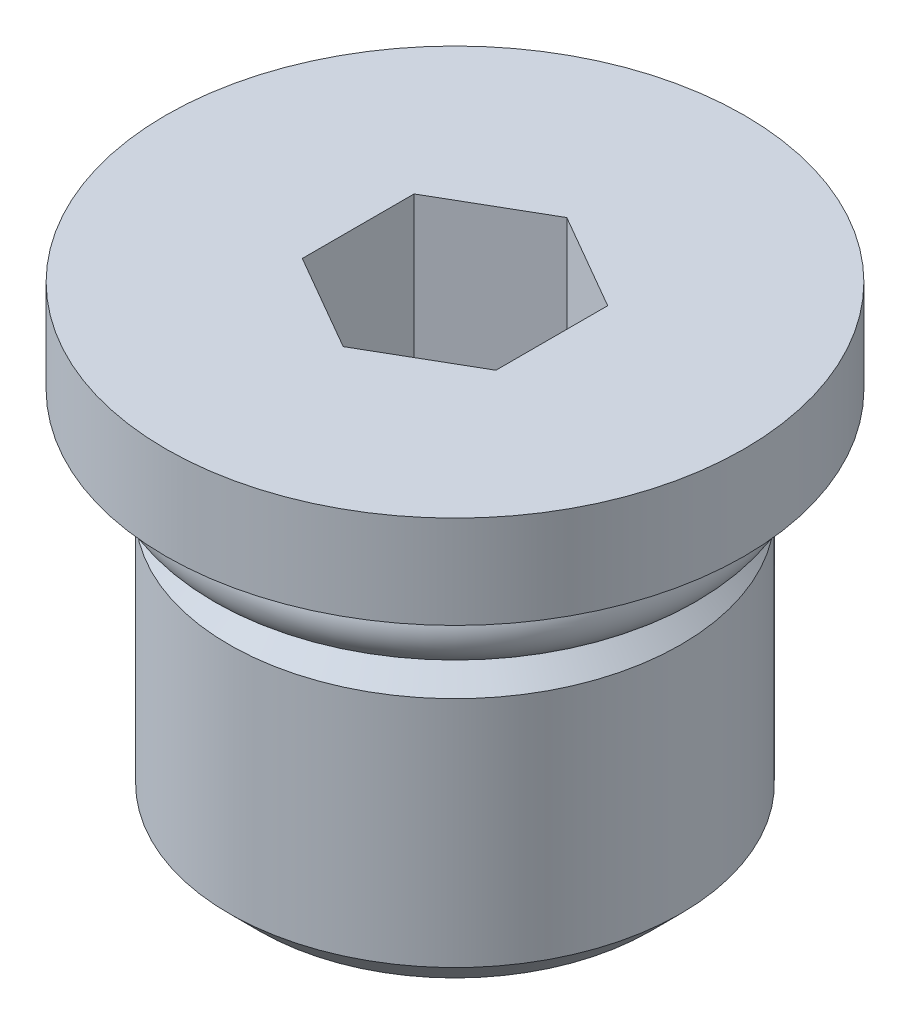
ISO-10303-21;
HEADER;
FILE_DESCRIPTION(('STEP AP214'),'2;1');
FILE_NAME('part.step','',(''),(''),'','','');
FILE_SCHEMA(('AUTOMOTIVE_DESIGN { 1 0 10303 214 1 1 1 1 }'));
ENDSEC;
DATA;
#1=APPLICATION_CONTEXT('core data for automotive mechanical design processes');
#2=APPLICATION_PROTOCOL_DEFINITION('international standard','automotive_design',2000,#1);
#3=PRODUCT_CONTEXT('',#1,'mechanical');
#4=PRODUCT('Part','Part','',(#3));
#5=PRODUCT_RELATED_PRODUCT_CATEGORY('part','',(#4));
#6=PRODUCT_DEFINITION_FORMATION('','',#4);
#7=PRODUCT_DEFINITION_CONTEXT('part definition',#1,'design');
#8=PRODUCT_DEFINITION('design','',#6,#7);
#9=PRODUCT_DEFINITION_SHAPE('','',#8);
#10=(LENGTH_UNIT() NAMED_UNIT(*) SI_UNIT(.MILLI.,.METRE.));
#11=(NAMED_UNIT(*) PLANE_ANGLE_UNIT() SI_UNIT($,.RADIAN.));
#12=(NAMED_UNIT(*) SI_UNIT($,.STERADIAN.) SOLID_ANGLE_UNIT());
#13=UNCERTAINTY_MEASURE_WITH_UNIT(LENGTH_MEASURE(1.E-05),#10,'distance_accuracy_value','');
#14=(GEOMETRIC_REPRESENTATION_CONTEXT(3) GLOBAL_UNCERTAINTY_ASSIGNED_CONTEXT((#13)) GLOBAL_UNIT_ASSIGNED_CONTEXT((#10,
#11,#12)) REPRESENTATION_CONTEXT('',''));
#15=CARTESIAN_POINT('',(0.,0.,0.));
#16=DIRECTION('',(0.,0.,1.));
#17=DIRECTION('',(1.,0.,0.));
#18=AXIS2_PLACEMENT_3D('',#15,#16,#17);
#19=CARTESIAN_POINT('',(0.,0.,0.));
#20=DIRECTION('',(0.,-1.,0.));
#21=DIRECTION('',(1.,0.,0.));
#22=AXIS2_PLACEMENT_3D('',#19,#20,#21);
#23=CYLINDRICAL_SURFACE('',#22,4.8006);
#24=CARTESIAN_POINT('',(0.,0.,0.));
#25=DIRECTION('',(0.,-1.,0.));
#26=DIRECTION('',(1.,0.,0.));
#27=AXIS2_PLACEMENT_3D('',#24,#25,#26);
#28=CIRCLE('',#27,4.8006);
#29=CARTESIAN_POINT('',(4.8006,0.,0.));
#30=VERTEX_POINT('',#29);
#31=EDGE_CURVE('E157',#30,#30,#28,.T.);
#32=ORIENTED_EDGE('',*,*,#31,.T.);
#33=EDGE_LOOP('',(#32));
#34=FACE_BOUND('',#33,.T.);
#35=CARTESIAN_POINT('',(0.,-0.165417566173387,0.));
#36=DIRECTION('',(0.,-1.,0.));
#37=DIRECTION('',(0.,0.,-1.));
#38=AXIS2_PLACEMENT_3D('',#35,#36,#37);
#39=CIRCLE('',#38,4.8006);
#40=CARTESIAN_POINT('',(0.,-0.165417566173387,-4.8006));
#41=VERTEX_POINT('',#40);
#42=EDGE_CURVE('E44',#41,#41,#39,.F.);
#43=ORIENTED_EDGE('',*,*,#42,.T.);
#44=EDGE_LOOP('',(#43));
#45=FACE_BOUND('',#44,.T.);
#46=ADVANCED_FACE('F40',(#34,#45),#23,.T.);
#47=CARTESIAN_POINT('',(-3.33066907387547E-13,2.28600000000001,0.));
#48=DIRECTION('',(0.,1.,0.));
#49=DIRECTION('',(-1.,0.,0.));
#50=AXIS2_PLACEMENT_3D('',#47,#48,#49);
#51=PLANE('',#50);
#52=DIRECTION('',(-0.866025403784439,0.,-0.5));
#53=VECTOR('',#52,1.);
#54=CARTESIAN_POINT('',(2.38124999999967,2.28600000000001,-1.3748153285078));
#55=LINE('',#54,#53);
#56=CARTESIAN_POINT('',(2.38124999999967,2.28600000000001,-1.3748153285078));
#57=VERTEX_POINT('',#56);
#58=CARTESIAN_POINT('',(-3.33066907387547E-13,2.28600000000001,-2.74963065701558));
#59=VERTEX_POINT('',#58);
#60=EDGE_CURVE('E57',#57,#59,#55,.T.);
#61=ORIENTED_EDGE('',*,*,#60,.F.);
#62=DIRECTION('',(0.,0.,-1.));
#63=VECTOR('',#62,1.);
#64=CARTESIAN_POINT('',(2.38124999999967,2.28600000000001,1.3748153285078));
#65=LINE('',#64,#63);
#66=CARTESIAN_POINT('',(2.38124999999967,2.28600000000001,1.3748153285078));
#67=VERTEX_POINT('',#66);
#68=EDGE_CURVE('E127',#67,#57,#65,.T.);
#69=ORIENTED_EDGE('',*,*,#68,.F.);
#70=DIRECTION('',(0.866025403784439,0.,-0.5));
#71=VECTOR('',#70,1.);
#72=CARTESIAN_POINT('',(-3.33066907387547E-13,2.28600000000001,2.74963065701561));
#73=LINE('',#72,#71);
#74=CARTESIAN_POINT('',(-3.33066907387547E-13,2.28600000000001,2.74963065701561));
#75=VERTEX_POINT('',#74);
#76=EDGE_CURVE('E121',#75,#67,#73,.T.);
#77=ORIENTED_EDGE('',*,*,#76,.F.);
#78=DIRECTION('',(0.866025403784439,0.,0.5));
#79=VECTOR('',#78,1.);
#80=CARTESIAN_POINT('',(-2.38125000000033,2.28600000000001,1.3748153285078));
#81=LINE('',#80,#79);
#82=CARTESIAN_POINT('',(-2.38125000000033,2.28600000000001,1.3748153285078));
#83=VERTEX_POINT('',#82);
#84=EDGE_CURVE('E119',#83,#75,#81,.T.);
#85=ORIENTED_EDGE('',*,*,#84,.F.);
#86=DIRECTION('',(0.,0.,1.));
#87=VECTOR('',#86,1.);
#88=CARTESIAN_POINT('',(-2.38125000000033,2.28600000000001,-1.37481532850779));
#89=LINE('',#88,#87);
#90=CARTESIAN_POINT('',(-2.38125000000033,2.28600000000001,-1.37481532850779));
#91=VERTEX_POINT('',#90);
#92=EDGE_CURVE('E100',#91,#83,#89,.T.);
#93=ORIENTED_EDGE('',*,*,#92,.F.);
#94=DIRECTION('',(-0.866025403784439,0.,0.5));
#95=VECTOR('',#94,1.);
#96=CARTESIAN_POINT('',(-3.33066907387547E-13,2.28600000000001,-2.74963065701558));
#97=LINE('',#96,#95);
#98=EDGE_CURVE('E111',#59,#91,#97,.T.);
#99=ORIENTED_EDGE('',*,*,#98,.F.);
#100=EDGE_LOOP('',(#61,#69,#77,#85,#93,#99));
#101=FACE_BOUND('',#100,.T.);
#102=CARTESIAN_POINT('',(-3.33066907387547E-13,2.28600000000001,0.));
#103=DIRECTION('',(0.,-1.,0.));
#104=DIRECTION('',(1.,0.,0.));
#105=AXIS2_PLACEMENT_3D('',#102,#103,#104);
#106=CIRCLE('',#105,7.112);
#107=CARTESIAN_POINT('',(7.11199999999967,2.28600000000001,0.));
#108=VERTEX_POINT('',#107);
#109=EDGE_CURVE('E163',#108,#108,#106,.T.);
#110=ORIENTED_EDGE('',*,*,#109,.F.);
#111=EDGE_LOOP('',(#110));
#112=FACE_BOUND('',#111,.T.);
#113=ADVANCED_FACE('F115',(#101,#112),#51,.T.);
#114=CARTESIAN_POINT('',(0.,0.,0.));
#115=DIRECTION('',(0.,-1.,0.));
#116=DIRECTION('',(1.,0.,0.));
#117=AXIS2_PLACEMENT_3D('',#114,#115,#116);
#118=CYLINDRICAL_SURFACE('',#117,7.112);
#119=ORIENTED_EDGE('',*,*,#109,.T.);
#120=EDGE_LOOP('',(#119));
#121=FACE_BOUND('',#120,.T.);
#122=CARTESIAN_POINT('',(0.,0.,0.));
#123=DIRECTION('',(0.,-1.,0.));
#124=DIRECTION('',(1.,0.,0.));
#125=AXIS2_PLACEMENT_3D('',#122,#123,#124);
#126=CIRCLE('',#125,7.112);
#127=CARTESIAN_POINT('',(7.112,0.,0.));
#128=VERTEX_POINT('',#127);
#129=EDGE_CURVE('E160',#128,#128,#126,.T.);
#130=ORIENTED_EDGE('',*,*,#129,.F.);
#131=EDGE_LOOP('',(#130));
#132=FACE_BOUND('',#131,.T.);
#133=ADVANCED_FACE('F197',(#121,#132),#118,.T.);
#134=CARTESIAN_POINT('',(7.11200000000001,0.,0.));
#135=DIRECTION('',(0.,-1.,0.));
#136=DIRECTION('',(1.,0.,0.));
#137=AXIS2_PLACEMENT_3D('',#134,#135,#136);
#138=PLANE('',#137);
#139=ORIENTED_EDGE('',*,*,#129,.T.);
#140=EDGE_LOOP('',(#139));
#141=FACE_BOUND('',#140,.T.);
#142=ORIENTED_EDGE('',*,*,#31,.F.);
#143=EDGE_LOOP('',(#142));
#144=FACE_BOUND('',#143,.T.);
#145=ADVANCED_FACE('F223',(#141,#144),#138,.T.);
#146=CARTESIAN_POINT('',(2.38125,-2.47649999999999,-1.3748153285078));
#147=DIRECTION('',(0.5,0.,-0.866025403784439));
#148=DIRECTION('',(-0.866025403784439,0.,-0.5));
#149=AXIS2_PLACEMENT_3D('',#146,#147,#148);
#150=PLANE('',#149);
#151=ORIENTED_EDGE('',*,*,#60,.T.);
#152=DIRECTION('',(0.,1.,0.));
#153=VECTOR('',#152,1.);
#154=CARTESIAN_POINT('',(0.,-2.47649999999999,-2.74963065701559));
#155=LINE('',#154,#153);
#156=CARTESIAN_POINT('',(0.,-2.47649999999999,-2.74963065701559));
#157=VERTEX_POINT('',#156);
#158=EDGE_CURVE('E108',#157,#59,#155,.T.);
#159=ORIENTED_EDGE('',*,*,#158,.F.);
#160=DIRECTION('',(-0.866025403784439,0.,-0.5));
#161=VECTOR('',#160,1.);
#162=CARTESIAN_POINT('',(2.38125,-2.47649999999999,-1.3748153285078));
#163=LINE('',#162,#161);
#164=CARTESIAN_POINT('',(2.38125,-2.47649999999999,-1.3748153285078));
#165=VERTEX_POINT('',#164);
#166=EDGE_CURVE('E129',#165,#157,#163,.T.);
#167=ORIENTED_EDGE('',*,*,#166,.F.);
#168=DIRECTION('',(0.,1.,0.));
#169=VECTOR('',#168,1.);
#170=CARTESIAN_POINT('',(2.38125,-2.47649999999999,-1.3748153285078));
#171=LINE('',#170,#169);
#172=EDGE_CURVE('E64',#165,#57,#171,.T.);
#173=ORIENTED_EDGE('',*,*,#172,.T.);
#174=EDGE_LOOP('',(#151,#159,#167,#173));
#175=FACE_BOUND('',#174,.T.);
#176=ADVANCED_FACE('F226',(#175),#150,.F.);
#177=CARTESIAN_POINT('',(2.38125,-2.47649999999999,1.3748153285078));
#178=DIRECTION('',(1.,0.,0.));
#179=DIRECTION('',(0.,0.,-1.));
#180=AXIS2_PLACEMENT_3D('',#177,#178,#179);
#181=PLANE('',#180);
#182=ORIENTED_EDGE('',*,*,#68,.T.);
#183=ORIENTED_EDGE('',*,*,#172,.F.);
#184=DIRECTION('',(0.,0.,-1.));
#185=VECTOR('',#184,1.);
#186=CARTESIAN_POINT('',(2.38125,-2.47649999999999,1.3748153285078));
#187=LINE('',#186,#185);
#188=CARTESIAN_POINT('',(2.38125,-2.47649999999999,1.3748153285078));
#189=VERTEX_POINT('',#188);
#190=EDGE_CURVE('E141',#189,#165,#187,.T.);
#191=ORIENTED_EDGE('',*,*,#190,.F.);
#192=DIRECTION('',(0.,1.,0.));
#193=VECTOR('',#192,1.);
#194=CARTESIAN_POINT('',(2.38125,-2.47649999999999,1.3748153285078));
#195=LINE('',#194,#193);
#196=EDGE_CURVE('E146',#189,#67,#195,.T.);
#197=ORIENTED_EDGE('',*,*,#196,.T.);
#198=EDGE_LOOP('',(#182,#183,#191,#197));
#199=FACE_BOUND('',#198,.T.);
#200=ADVANCED_FACE('F231',(#199),#181,.F.);
#201=CARTESIAN_POINT('',(0.,-2.47649999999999,2.74963065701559));
#202=DIRECTION('',(0.5,0.,0.866025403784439));
#203=DIRECTION('',(0.866025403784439,0.,-0.5));
#204=AXIS2_PLACEMENT_3D('',#201,#202,#203);
#205=PLANE('',#204);
#206=ORIENTED_EDGE('',*,*,#76,.T.);
#207=ORIENTED_EDGE('',*,*,#196,.F.);
#208=DIRECTION('',(0.866025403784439,0.,-0.5));
#209=VECTOR('',#208,1.);
#210=CARTESIAN_POINT('',(0.,-2.47649999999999,2.74963065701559));
#211=LINE('',#210,#209);
#212=CARTESIAN_POINT('',(0.,-2.47649999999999,2.74963065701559));
#213=VERTEX_POINT('',#212);
#214=EDGE_CURVE('E138',#213,#189,#211,.T.);
#215=ORIENTED_EDGE('',*,*,#214,.F.);
#216=DIRECTION('',(0.,1.,0.));
#217=VECTOR('',#216,1.);
#218=CARTESIAN_POINT('',(0.,-2.47649999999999,2.74963065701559));
#219=LINE('',#218,#217);
#220=EDGE_CURVE('E148',#213,#75,#219,.T.);
#221=ORIENTED_EDGE('',*,*,#220,.T.);
#222=EDGE_LOOP('',(#206,#207,#215,#221));
#223=FACE_BOUND('',#222,.T.);
#224=ADVANCED_FACE('F240',(#223),#205,.F.);
#225=CARTESIAN_POINT('',(-2.38125,-2.47649999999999,1.3748153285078));
#226=DIRECTION('',(-0.5,0.,0.866025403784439));
#227=DIRECTION('',(0.866025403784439,0.,0.5));
#228=AXIS2_PLACEMENT_3D('',#225,#226,#227);
#229=PLANE('',#228);
#230=ORIENTED_EDGE('',*,*,#84,.T.);
#231=ORIENTED_EDGE('',*,*,#220,.F.);
#232=DIRECTION('',(0.866025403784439,0.,0.5));
#233=VECTOR('',#232,1.);
#234=CARTESIAN_POINT('',(-2.38125,-2.47649999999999,1.3748153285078));
#235=LINE('',#234,#233);
#236=CARTESIAN_POINT('',(-2.38125,-2.47649999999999,1.3748153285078));
#237=VERTEX_POINT('',#236);
#238=EDGE_CURVE('E135',#237,#213,#235,.T.);
#239=ORIENTED_EDGE('',*,*,#238,.F.);
#240=DIRECTION('',(0.,1.,0.));
#241=VECTOR('',#240,1.);
#242=CARTESIAN_POINT('',(-2.38125,-2.47649999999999,1.3748153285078));
#243=LINE('',#242,#241);
#244=EDGE_CURVE('E107',#237,#83,#243,.T.);
#245=ORIENTED_EDGE('',*,*,#244,.T.);
#246=EDGE_LOOP('',(#230,#231,#239,#245));
#247=FACE_BOUND('',#246,.T.);
#248=ADVANCED_FACE('F247',(#247),#229,.F.);
#249=CARTESIAN_POINT('',(-2.38125,-2.47649999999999,-1.3748153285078));
#250=DIRECTION('',(-1.,0.,0.));
#251=DIRECTION('',(0.,-1.,0.));
#252=AXIS2_PLACEMENT_3D('',#249,#250,#251);
#253=PLANE('',#252);
#254=ORIENTED_EDGE('',*,*,#92,.T.);
#255=ORIENTED_EDGE('',*,*,#244,.F.);
#256=DIRECTION('',(0.,0.,1.));
#257=VECTOR('',#256,1.);
#258=CARTESIAN_POINT('',(-2.38125,-2.47649999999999,-1.3748153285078));
#259=LINE('',#258,#257);
#260=CARTESIAN_POINT('',(-2.38125,-2.47649999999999,-1.3748153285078));
#261=VERTEX_POINT('',#260);
#262=EDGE_CURVE('E103',#261,#237,#259,.T.);
#263=ORIENTED_EDGE('',*,*,#262,.F.);
#264=DIRECTION('',(0.,1.,0.));
#265=VECTOR('',#264,1.);
#266=CARTESIAN_POINT('',(-2.38125,-2.47649999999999,-1.3748153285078));
#267=LINE('',#266,#265);
#268=EDGE_CURVE('E96',#261,#91,#267,.T.);
#269=ORIENTED_EDGE('',*,*,#268,.T.);
#270=EDGE_LOOP('',(#254,#255,#263,#269));
#271=FACE_BOUND('',#270,.T.);
#272=ADVANCED_FACE('F98',(#271),#253,.F.);
#273=CARTESIAN_POINT('',(0.,-2.47649999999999,-2.74963065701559));
#274=DIRECTION('',(-0.5,0.,-0.866025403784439));
#275=DIRECTION('',(-0.866025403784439,0.,0.5));
#276=AXIS2_PLACEMENT_3D('',#273,#274,#275);
#277=PLANE('',#276);
#278=ORIENTED_EDGE('',*,*,#98,.T.);
#279=ORIENTED_EDGE('',*,*,#268,.F.);
#280=DIRECTION('',(-0.866025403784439,0.,0.5));
#281=VECTOR('',#280,1.);
#282=CARTESIAN_POINT('',(0.,-2.47649999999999,-2.74963065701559));
#283=LINE('',#282,#281);
#284=EDGE_CURVE('E132',#157,#261,#283,.T.);
#285=ORIENTED_EDGE('',*,*,#284,.F.);
#286=ORIENTED_EDGE('',*,*,#158,.T.);
#287=EDGE_LOOP('',(#278,#279,#285,#286));
#288=FACE_BOUND('',#287,.T.);
#289=ADVANCED_FACE('F112',(#288),#277,.F.);
#290=CARTESIAN_POINT('',(2.38125,-2.47649999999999,-1.3748153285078));
#291=DIRECTION('',(0.,-1.,0.));
#292=DIRECTION('',(0.,0.,-1.));
#293=AXIS2_PLACEMENT_3D('',#290,#291,#292);
#294=PLANE('',#293);
#295=ORIENTED_EDGE('',*,*,#166,.T.);
#296=ORIENTED_EDGE('',*,*,#284,.T.);
#297=ORIENTED_EDGE('',*,*,#262,.T.);
#298=ORIENTED_EDGE('',*,*,#238,.T.);
#299=ORIENTED_EDGE('',*,*,#214,.T.);
#300=ORIENTED_EDGE('',*,*,#190,.T.);
#301=EDGE_LOOP('',(#295,#296,#297,#298,#299,#300));
#302=FACE_BOUND('',#301,.T.);
#303=ADVANCED_FACE('F179',(#302),#294,.F.);
#304=CARTESIAN_POINT('',(0.,-0.927099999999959,0.));
#305=DIRECTION('',(0.,1.,0.));
#306=DIRECTION('',(0.,0.,1.));
#307=AXIS2_PLACEMENT_3D('',#304,#305,#306);
#308=TOROIDAL_SURFACE('',#307,5.2832,0.9017);
#309=ORIENTED_EDGE('',*,*,#42,.F.);
#310=EDGE_LOOP('',(#309));
#311=FACE_BOUND('',#310,.T.);
#312=CARTESIAN_POINT('',(0.,-1.68878243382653,0.));
#313=DIRECTION('',(0.,1.,0.));
#314=DIRECTION('',(0.,0.,1.));
#315=AXIS2_PLACEMENT_3D('',#312,#313,#314);
#316=CIRCLE('',#315,4.8006);
#317=CARTESIAN_POINT('',(0.,-1.68878243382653,4.8006));
#318=VERTEX_POINT('',#317);
#319=EDGE_CURVE('E167',#318,#318,#316,.F.);
#320=ORIENTED_EDGE('',*,*,#319,.F.);
#321=EDGE_LOOP('',(#320));
#322=FACE_BOUND('',#321,.T.);
#323=ADVANCED_FACE('F175',(#311,#322),#308,.T.);
#324=CARTESIAN_POINT('',(4.80060000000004,-9.14400000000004,0.));
#325=DIRECTION('',(0.,-1.,0.));
#326=DIRECTION('',(1.,0.,0.));
#327=AXIS2_PLACEMENT_3D('',#324,#325,#326);
#328=PLANE('',#327);
#329=CARTESIAN_POINT('',(0.,-9.14400000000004,0.));
#330=DIRECTION('',(0.,-1.,0.));
#331=DIRECTION('',(1.,0.,0.));
#332=AXIS2_PLACEMENT_3D('',#329,#330,#331);
#333=CIRCLE('',#332,4.8006);
#334=CARTESIAN_POINT('',(4.8006,-9.14400000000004,0.));
#335=VERTEX_POINT('',#334);
#336=EDGE_CURVE('E49',#335,#335,#333,.T.);
#337=ORIENTED_EDGE('',*,*,#336,.T.);
#338=EDGE_LOOP('',(#337));
#339=FACE_BOUND('',#338,.T.);
#340=ADVANCED_FACE('F178',(#339),#328,.T.);
#341=CARTESIAN_POINT('',(0.,-9.14400000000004,0.));
#342=DIRECTION('',(0.,1.,0.));
#343=DIRECTION('',(-1.,0.,0.));
#344=AXIS2_PLACEMENT_3D('',#341,#342,#343);
#345=CONICAL_SURFACE('',#344,4.8006,0.785398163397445);
#346=CARTESIAN_POINT('',(0.,-8.38834999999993,0.));
#347=DIRECTION('',(0.,-1.,0.));
#348=DIRECTION('',(1.,0.,0.));
#349=AXIS2_PLACEMENT_3D('',#346,#347,#348);
#350=CIRCLE('',#349,5.55625);
#351=CARTESIAN_POINT('',(5.55625,-8.38834999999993,0.));
#352=VERTEX_POINT('',#351);
#353=EDGE_CURVE('E11',#352,#352,#350,.T.);
#354=ORIENTED_EDGE('',*,*,#353,.T.);
#355=EDGE_LOOP('',(#354));
#356=FACE_BOUND('',#355,.T.);
#357=ORIENTED_EDGE('',*,*,#336,.F.);
#358=EDGE_LOOP('',(#357));
#359=FACE_BOUND('',#358,.T.);
#360=ADVANCED_FACE('F185',(#356,#359),#345,.T.);
#361=CARTESIAN_POINT('',(0.,0.,0.));
#362=DIRECTION('',(0.,-1.,0.));
#363=DIRECTION('',(1.,0.,0.));
#364=AXIS2_PLACEMENT_3D('',#361,#362,#363);
#365=CYLINDRICAL_SURFACE('',#364,5.55625);
#366=CARTESIAN_POINT('',(0.,-2.66064999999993,0.));
#367=DIRECTION('',(0.,-1.,0.));
#368=DIRECTION('',(1.,0.,0.));
#369=AXIS2_PLACEMENT_3D('',#366,#367,#368);
#370=CIRCLE('',#369,5.55625);
#371=CARTESIAN_POINT('',(5.55625,-2.66064999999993,0.));
#372=VERTEX_POINT('',#371);
#373=EDGE_CURVE('E145',#372,#372,#370,.T.);
#374=ORIENTED_EDGE('',*,*,#373,.T.);
#375=EDGE_LOOP('',(#374));
#376=FACE_BOUND('',#375,.T.);
#377=ORIENTED_EDGE('',*,*,#353,.F.);
#378=EDGE_LOOP('',(#377));
#379=FACE_BOUND('',#378,.T.);
#380=ADVANCED_FACE('F42',(#376,#379),#365,.T.);
#381=CARTESIAN_POINT('',(0.,-2.66064999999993,0.));
#382=DIRECTION('',(0.,-1.,0.));
#383=DIRECTION('',(1.,0.,0.));
#384=AXIS2_PLACEMENT_3D('',#381,#382,#383);
#385=CONICAL_SURFACE('',#384,5.55625,0.785398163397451);
#386=CARTESIAN_POINT('',(0.,-1.90500000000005,0.));
#387=DIRECTION('',(0.,-1.,0.));
#388=DIRECTION('',(1.,0.,0.));
#389=AXIS2_PLACEMENT_3D('',#386,#387,#388);
#390=CIRCLE('',#389,4.8006);
#391=CARTESIAN_POINT('',(4.8006,-1.90500000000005,0.));
#392=VERTEX_POINT('',#391);
#393=EDGE_CURVE('E154',#392,#392,#390,.T.);
#394=ORIENTED_EDGE('',*,*,#393,.T.);
#395=EDGE_LOOP('',(#394));
#396=FACE_BOUND('',#395,.T.);
#397=ORIENTED_EDGE('',*,*,#373,.F.);
#398=EDGE_LOOP('',(#397));
#399=FACE_BOUND('',#398,.T.);
#400=ADVANCED_FACE('F202',(#396,#399),#385,.T.);
#401=ORIENTED_EDGE('',*,*,#393,.F.);
#402=EDGE_LOOP('',(#401));
#403=FACE_BOUND('',#402,.T.);
#404=ORIENTED_EDGE('',*,*,#319,.T.);
#405=EDGE_LOOP('',(#404));
#406=FACE_BOUND('',#405,.T.);
#407=ADVANCED_FACE('F193',(#403,#406),#23,.T.);
#408=CLOSED_SHELL('',(#46,#113,#133,#145,#176,#200,#224,#248,#272,#289,#303,#323,#340,#360,#380,
#400,#407));
#409=MANIFOLD_SOLID_BREP('B2',#408);
#410=ADVANCED_BREP_SHAPE_REPRESENTATION('',(#18,#409),#14);
#411=SHAPE_DEFINITION_REPRESENTATION(#9,#410);
ENDSEC;
END-ISO-10303-21;
